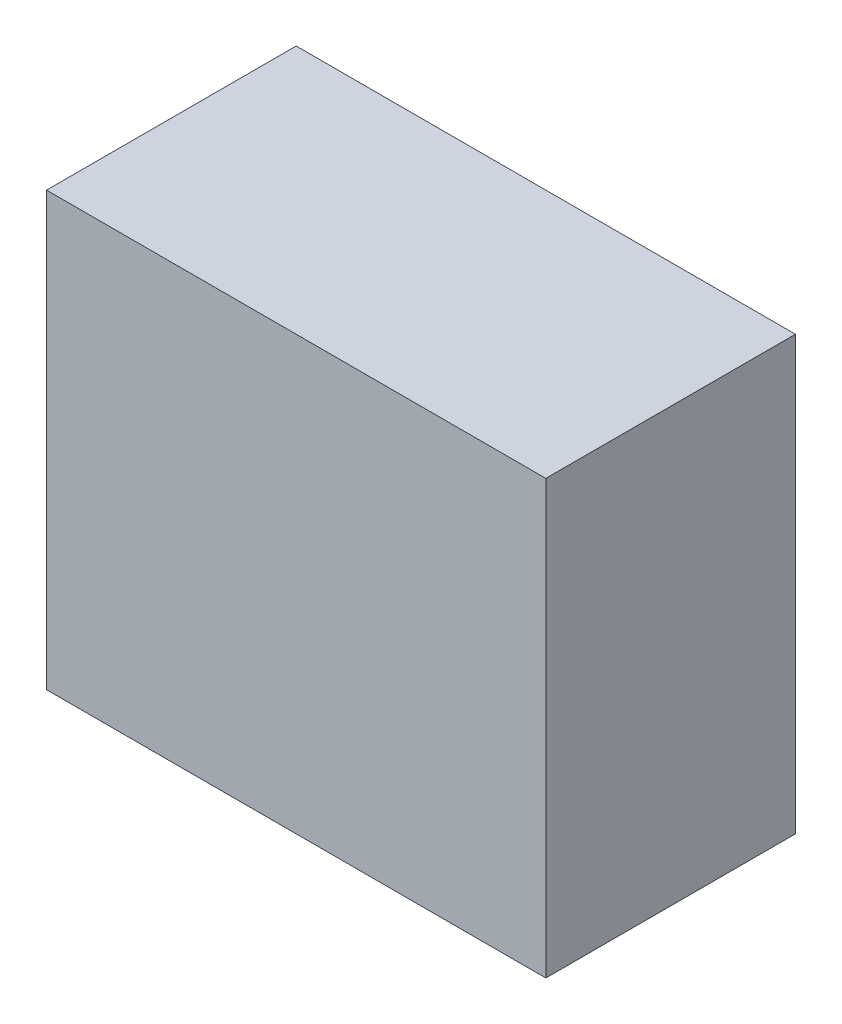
from build123d import *

# Parameters (mm, degrees)
SKETCH_1_W      = 1.5
SKETCH_1_H      = 2.6
EXTRUDE_1_DEPTH = 1.5
SKETCH_2_W      = 1.5
SKETCH_2_H      = 2.6
EXTRUDE_2_DEPTH = 1.5


with BuildPart() as part:
    # Sketch 1 → Extrude 1 (new body)
    with BuildSketch(Plane.XY):
        with Locations((0.75, 0)):
            Rectangle(SKETCH_1_W, SKETCH_1_H)
    extrude(amount=EXTRUDE_1_DEPTH)

    # Sketch 2 → Extrude 2 (add)
    with BuildSketch(Plane.XY.offset(1.5)):
        with Locations((-0.75, 0)):
            Rectangle(SKETCH_2_W, SKETCH_2_H)
    extrude(amount=-EXTRUDE_2_DEPTH)


solid = part.part
